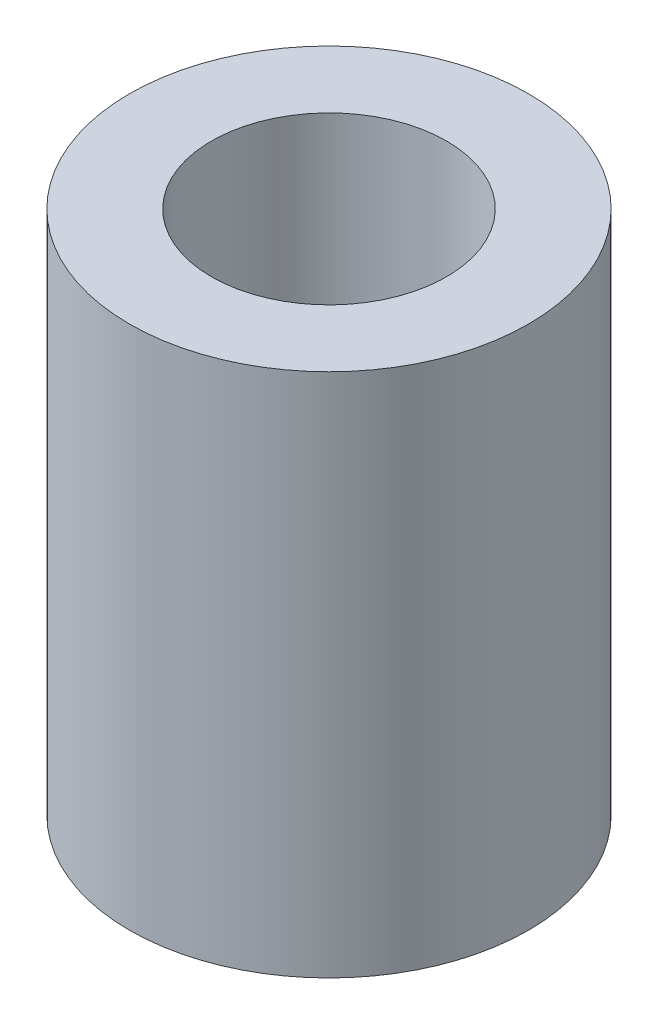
ISO-10303-21;
HEADER;
FILE_DESCRIPTION(('STEP AP214'),'2;1');
FILE_NAME('part.step','',(''),(''),'','','');
FILE_SCHEMA(('AUTOMOTIVE_DESIGN { 1 0 10303 214 1 1 1 1 }'));
ENDSEC;
DATA;
#1=APPLICATION_CONTEXT('core data for automotive mechanical design processes');
#2=APPLICATION_PROTOCOL_DEFINITION('international standard','automotive_design',2000,#1);
#3=PRODUCT_CONTEXT('',#1,'mechanical');
#4=PRODUCT('Part','Part','',(#3));
#5=PRODUCT_RELATED_PRODUCT_CATEGORY('part','',(#4));
#6=PRODUCT_DEFINITION_FORMATION('','',#4);
#7=PRODUCT_DEFINITION_CONTEXT('part definition',#1,'design');
#8=PRODUCT_DEFINITION('design','',#6,#7);
#9=PRODUCT_DEFINITION_SHAPE('','',#8);
#10=(LENGTH_UNIT() NAMED_UNIT(*) SI_UNIT(.MILLI.,.METRE.));
#11=(NAMED_UNIT(*) PLANE_ANGLE_UNIT() SI_UNIT($,.RADIAN.));
#12=(NAMED_UNIT(*) SI_UNIT($,.STERADIAN.) SOLID_ANGLE_UNIT());
#13=UNCERTAINTY_MEASURE_WITH_UNIT(LENGTH_MEASURE(1.E-05),#10,'distance_accuracy_value','');
#14=(GEOMETRIC_REPRESENTATION_CONTEXT(3) GLOBAL_UNCERTAINTY_ASSIGNED_CONTEXT((#13)) GLOBAL_UNIT_ASSIGNED_CONTEXT((#10,
#11,#12)) REPRESENTATION_CONTEXT('',''));
#15=CARTESIAN_POINT('',(0.,0.,0.));
#16=DIRECTION('',(0.,0.,1.));
#17=DIRECTION('',(1.,0.,0.));
#18=AXIS2_PLACEMENT_3D('',#15,#16,#17);
#19=CARTESIAN_POINT('',(0.,6.35,0.));
#20=DIRECTION('',(0.,-1.,0.));
#21=DIRECTION('',(0.,0.,-1.));
#22=AXIS2_PLACEMENT_3D('',#19,#20,#21);
#23=CYLINDRICAL_SURFACE('',#22,2.413);
#24=CARTESIAN_POINT('',(0.,6.35,0.));
#25=DIRECTION('',(0.,1.,0.));
#26=DIRECTION('',(0.,0.,1.));
#27=AXIS2_PLACEMENT_3D('',#24,#25,#26);
#28=CIRCLE('',#27,2.413);
#29=CARTESIAN_POINT('',(0.,6.35,2.413));
#30=VERTEX_POINT('',#29);
#31=EDGE_CURVE('E10',#30,#30,#28,.T.);
#32=ORIENTED_EDGE('',*,*,#31,.F.);
#33=EDGE_LOOP('',(#32));
#34=FACE_BOUND('',#33,.T.);
#35=CARTESIAN_POINT('',(0.,0.,0.));
#36=DIRECTION('',(0.,1.,0.));
#37=DIRECTION('',(0.,0.,1.));
#38=AXIS2_PLACEMENT_3D('',#35,#36,#37);
#39=CIRCLE('',#38,2.413);
#40=CARTESIAN_POINT('',(0.,0.,2.413));
#41=VERTEX_POINT('',#40);
#42=EDGE_CURVE('E40',#41,#41,#39,.T.);
#43=ORIENTED_EDGE('',*,*,#42,.T.);
#44=EDGE_LOOP('',(#43));
#45=FACE_BOUND('',#44,.T.);
#46=ADVANCED_FACE('F34',(#34,#45),#23,.T.);
#47=CARTESIAN_POINT('',(0.,6.35,0.));
#48=DIRECTION('',(0.,1.,0.));
#49=DIRECTION('',(0.,0.,1.));
#50=AXIS2_PLACEMENT_3D('',#47,#48,#49);
#51=PLANE('',#50);
#52=CARTESIAN_POINT('',(0.,6.35,0.));
#53=DIRECTION('',(0.,1.,0.));
#54=DIRECTION('',(0.,0.,1.));
#55=AXIS2_PLACEMENT_3D('',#52,#53,#54);
#56=CIRCLE('',#55,1.4224);
#57=CARTESIAN_POINT('',(0.,6.35,1.4224));
#58=VERTEX_POINT('',#57);
#59=EDGE_CURVE('E44',#58,#58,#56,.T.);
#60=ORIENTED_EDGE('',*,*,#59,.F.);
#61=EDGE_LOOP('',(#60));
#62=FACE_BOUND('',#61,.T.);
#63=ORIENTED_EDGE('',*,*,#31,.T.);
#64=EDGE_LOOP('',(#63));
#65=FACE_BOUND('',#64,.T.);
#66=ADVANCED_FACE('F63',(#62,#65),#51,.T.);
#67=CARTESIAN_POINT('',(0.,0.,0.));
#68=DIRECTION('',(0.,1.,0.));
#69=DIRECTION('',(0.,0.,1.));
#70=AXIS2_PLACEMENT_3D('',#67,#68,#69);
#71=PLANE('',#70);
#72=CARTESIAN_POINT('',(0.,0.,0.));
#73=DIRECTION('',(0.,1.,0.));
#74=DIRECTION('',(0.,0.,1.));
#75=AXIS2_PLACEMENT_3D('',#72,#73,#74);
#76=CIRCLE('',#75,1.4224);
#77=CARTESIAN_POINT('',(0.,0.,1.4224));
#78=VERTEX_POINT('',#77);
#79=EDGE_CURVE('E48',#78,#78,#76,.T.);
#80=ORIENTED_EDGE('',*,*,#79,.T.);
#81=EDGE_LOOP('',(#80));
#82=FACE_BOUND('',#81,.T.);
#83=ORIENTED_EDGE('',*,*,#42,.F.);
#84=EDGE_LOOP('',(#83));
#85=FACE_BOUND('',#84,.T.);
#86=ADVANCED_FACE('F54',(#82,#85),#71,.F.);
#87=CARTESIAN_POINT('',(0.,6.35,0.));
#88=DIRECTION('',(0.,1.,0.));
#89=DIRECTION('',(0.,0.,1.));
#90=AXIS2_PLACEMENT_3D('',#87,#88,#89);
#91=CYLINDRICAL_SURFACE('',#90,1.4224);
#92=ORIENTED_EDGE('',*,*,#79,.F.);
#93=EDGE_LOOP('',(#92));
#94=FACE_BOUND('',#93,.T.);
#95=ORIENTED_EDGE('',*,*,#59,.T.);
#96=EDGE_LOOP('',(#95));
#97=FACE_BOUND('',#96,.T.);
#98=ADVANCED_FACE('F57',(#94,#97),#91,.F.);
#99=CLOSED_SHELL('',(#46,#66,#86,#98));
#100=MANIFOLD_SOLID_BREP('B2',#99);
#101=ADVANCED_BREP_SHAPE_REPRESENTATION('',(#18,#100),#14);
#102=SHAPE_DEFINITION_REPRESENTATION(#9,#101);
ENDSEC;
END-ISO-10303-21;
